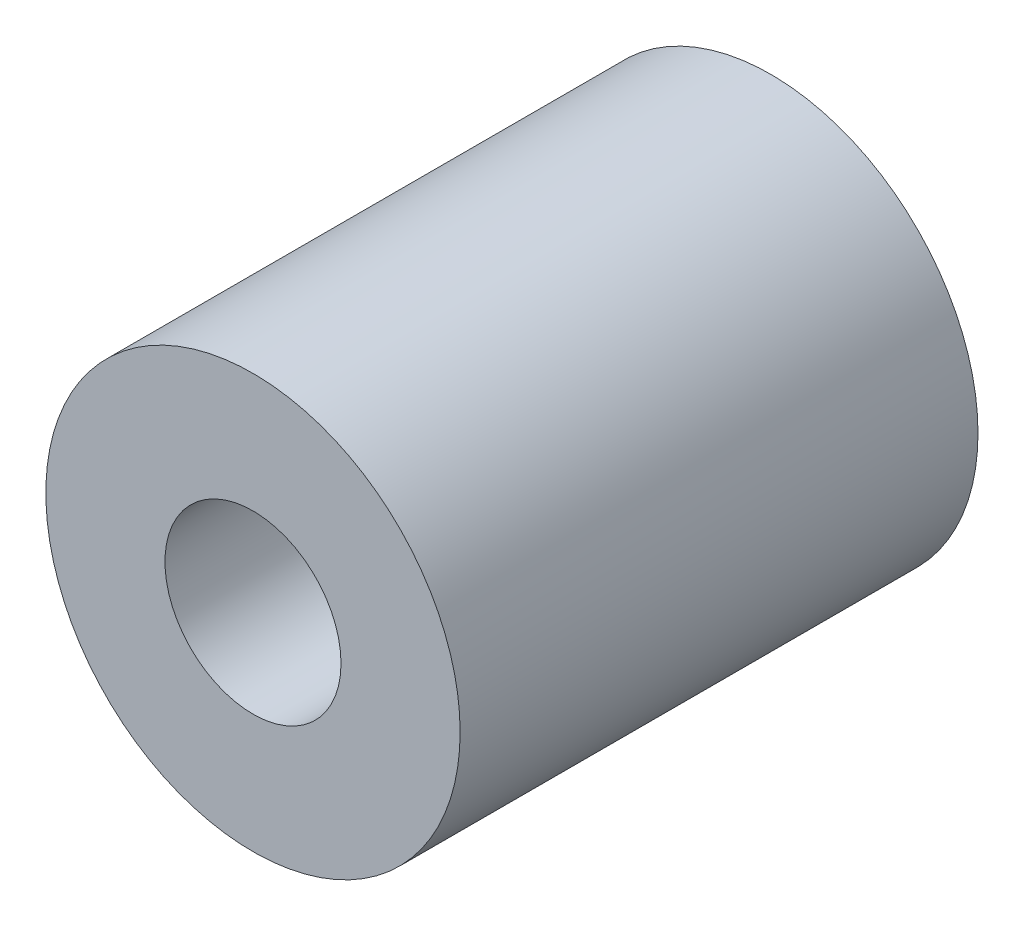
from build123d import *

# Parameters (mm, degrees)
SKETCH_1_R         = 4
SKETCH_1_R_2       = 1.7
M3_SPACER_10_DEPTH = 10


with BuildPart() as part:
    # Sketch 1 → M3_spacer_10 (new body)
    with BuildSketch(Plane.XY):
        Circle(SKETCH_1_R)
        Circle(SKETCH_1_R_2, mode=Mode.SUBTRACT)
    extrude(amount=M3_SPACER_10_DEPTH)


solid = part.part
